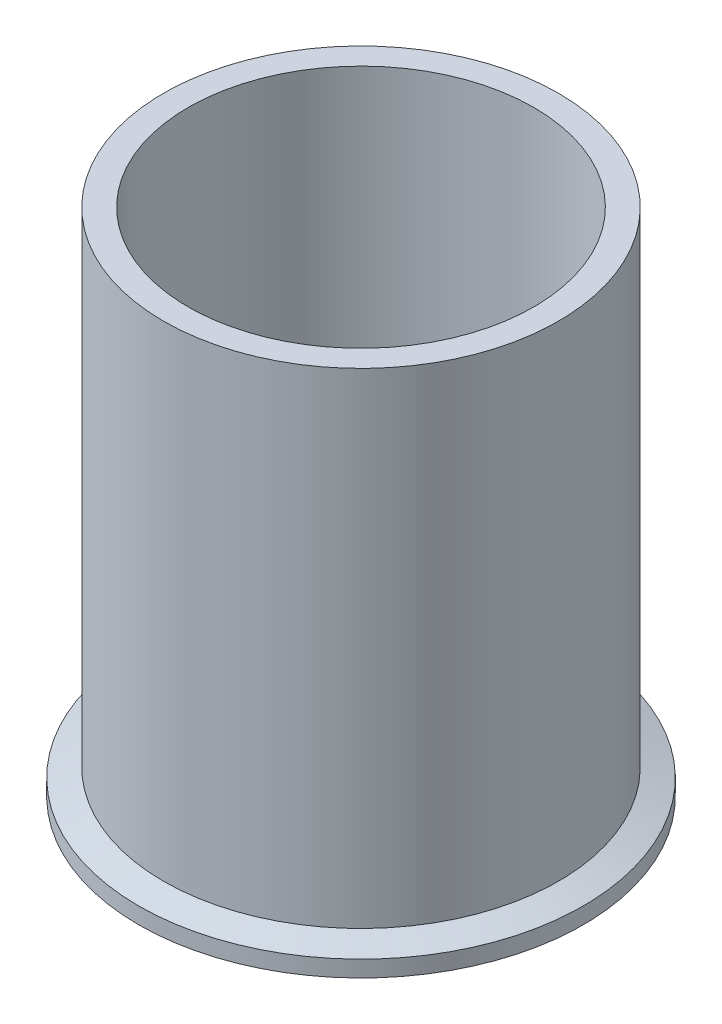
ISO-10303-21;
HEADER;
FILE_DESCRIPTION(('STEP AP214'),'2;1');
FILE_NAME('part.step','',(''),(''),'','','');
FILE_SCHEMA(('AUTOMOTIVE_DESIGN { 1 0 10303 214 1 1 1 1 }'));
ENDSEC;
DATA;
#1=APPLICATION_CONTEXT('core data for automotive mechanical design processes');
#2=APPLICATION_PROTOCOL_DEFINITION('international standard','automotive_design',2000,#1);
#3=PRODUCT_CONTEXT('',#1,'mechanical');
#4=PRODUCT('Part','Part','',(#3));
#5=PRODUCT_RELATED_PRODUCT_CATEGORY('part','',(#4));
#6=PRODUCT_DEFINITION_FORMATION('','',#4);
#7=PRODUCT_DEFINITION_CONTEXT('part definition',#1,'design');
#8=PRODUCT_DEFINITION('design','',#6,#7);
#9=PRODUCT_DEFINITION_SHAPE('','',#8);
#10=(LENGTH_UNIT() NAMED_UNIT(*) SI_UNIT(.MILLI.,.METRE.));
#11=(NAMED_UNIT(*) PLANE_ANGLE_UNIT() SI_UNIT($,.RADIAN.));
#12=(NAMED_UNIT(*) SI_UNIT($,.STERADIAN.) SOLID_ANGLE_UNIT());
#13=UNCERTAINTY_MEASURE_WITH_UNIT(LENGTH_MEASURE(1.E-05),#10,'distance_accuracy_value','');
#14=(GEOMETRIC_REPRESENTATION_CONTEXT(3) GLOBAL_UNCERTAINTY_ASSIGNED_CONTEXT((#13)) GLOBAL_UNIT_ASSIGNED_CONTEXT((#10,
#11,#12)) REPRESENTATION_CONTEXT('',''));
#15=CARTESIAN_POINT('',(0.,0.,0.));
#16=DIRECTION('',(0.,0.,1.));
#17=DIRECTION('',(1.,0.,0.));
#18=AXIS2_PLACEMENT_3D('',#15,#16,#17);
#19=CARTESIAN_POINT('',(0.,0.,0.));
#20=DIRECTION('',(0.,-1.,0.));
#21=DIRECTION('',(0.,0.,-1.));
#22=AXIS2_PLACEMENT_3D('',#19,#20,#21);
#23=CONICAL_SURFACE('',#22,36.788103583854,0.401425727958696);
#24=CARTESIAN_POINT('',(0.,0.872854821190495,0.));
#25=DIRECTION('',(0.,-1.,0.));
#26=DIRECTION('',(0.,0.,-1.));
#27=AXIS2_PLACEMENT_3D('',#24,#25,#26);
#28=CIRCLE('',#27,36.4175986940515);
#29=CARTESIAN_POINT('',(0.,0.872854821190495,-36.4175986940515));
#30=VERTEX_POINT('',#29);
#31=EDGE_CURVE('E10',#30,#30,#28,.T.);
#32=ORIENTED_EDGE('',*,*,#31,.F.);
#33=EDGE_LOOP('',(#32));
#34=FACE_BOUND('',#33,.T.);
#35=CARTESIAN_POINT('',(0.,0.,0.));
#36=DIRECTION('',(0.,-1.,0.));
#37=DIRECTION('',(0.,0.,-1.));
#38=AXIS2_PLACEMENT_3D('',#35,#36,#37);
#39=CIRCLE('',#38,36.788103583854);
#40=CARTESIAN_POINT('',(0.,0.,-36.788103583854));
#41=VERTEX_POINT('',#40);
#42=EDGE_CURVE('E67',#41,#41,#39,.T.);
#43=ORIENTED_EDGE('',*,*,#42,.T.);
#44=EDGE_LOOP('',(#43));
#45=FACE_BOUND('',#44,.T.);
#46=ADVANCED_FACE('F33',(#34,#45),#23,.F.);
#47=CARTESIAN_POINT('',(0.,0.4064,0.));
#48=DIRECTION('',(0.,-1.,0.));
#49=DIRECTION('',(0.,0.,-1.));
#50=AXIS2_PLACEMENT_3D('',#47,#48,#49);
#51=TOROIDAL_SURFACE('',#50,35.3187,1.1938);
#52=CARTESIAN_POINT('',(0.,0.762227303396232,0.));
#53=DIRECTION('',(0.,-1.,0.));
#54=DIRECTION('',(0.,0.,-1.));
#55=AXIS2_PLACEMENT_3D('',#52,#53,#54);
#56=CIRCLE('',#55,34.1791626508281);
#57=CARTESIAN_POINT('',(0.,0.762227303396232,-34.1791626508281));
#58=VERTEX_POINT('',#57);
#59=EDGE_CURVE('E39',#58,#58,#56,.T.);
#60=ORIENTED_EDGE('',*,*,#59,.F.);
#61=EDGE_LOOP('',(#60));
#62=FACE_BOUND('',#61,.T.);
#63=ORIENTED_EDGE('',*,*,#31,.T.);
#64=EDGE_LOOP('',(#63));
#65=FACE_BOUND('',#64,.T.);
#66=ADVANCED_FACE('F114',(#62,#65),#51,.F.);
#67=CARTESIAN_POINT('',(0.,0.762227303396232,0.));
#68=DIRECTION('',(0.,1.,0.));
#69=DIRECTION('',(0.,0.,1.));
#70=AXIS2_PLACEMENT_3D('',#67,#68,#69);
#71=CONICAL_SURFACE('',#70,34.1791626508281,0.401425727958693);
#72=CARTESIAN_POINT('',(0.,0.,0.));
#73=DIRECTION('',(0.,-1.,0.));
#74=DIRECTION('',(0.,0.,-1.));
#75=AXIS2_PLACEMENT_3D('',#72,#73,#74);
#76=CIRCLE('',#75,33.855616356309);
#77=CARTESIAN_POINT('',(0.,0.,-33.855616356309));
#78=VERTEX_POINT('',#77);
#79=EDGE_CURVE('E43',#78,#78,#76,.T.);
#80=ORIENTED_EDGE('',*,*,#79,.F.);
#81=EDGE_LOOP('',(#80));
#82=FACE_BOUND('',#81,.T.);
#83=ORIENTED_EDGE('',*,*,#59,.T.);
#84=EDGE_LOOP('',(#83));
#85=FACE_BOUND('',#84,.T.);
#86=ADVANCED_FACE('F110',(#82,#85),#71,.T.);
#87=CARTESIAN_POINT('',(0.,0.,0.));
#88=DIRECTION('',(0.,1.,0.));
#89=DIRECTION('',(0.,0.,1.));
#90=AXIS2_PLACEMENT_3D('',#87,#88,#89);
#91=PLANE('',#90);
#92=CARTESIAN_POINT('',(0.,0.,0.));
#93=DIRECTION('',(0.,-1.,0.));
#94=DIRECTION('',(0.,0.,-1.));
#95=AXIS2_PLACEMENT_3D('',#92,#93,#94);
#96=CIRCLE('',#95,30.099);
#97=CARTESIAN_POINT('',(0.,0.,-30.099));
#98=VERTEX_POINT('',#97);
#99=EDGE_CURVE('E47',#98,#98,#96,.T.);
#100=ORIENTED_EDGE('',*,*,#99,.F.);
#101=EDGE_LOOP('',(#100));
#102=FACE_BOUND('',#101,.T.);
#103=ORIENTED_EDGE('',*,*,#79,.T.);
#104=EDGE_LOOP('',(#103));
#105=FACE_BOUND('',#104,.T.);
#106=ADVANCED_FACE('F104',(#102,#105),#91,.F.);
#107=CARTESIAN_POINT('',(0.,0.,0.));
#108=DIRECTION('',(0.,-1.,0.));
#109=DIRECTION('',(0.,0.,-1.));
#110=AXIS2_PLACEMENT_3D('',#107,#108,#109);
#111=CYLINDRICAL_SURFACE('',#110,30.099);
#112=ORIENTED_EDGE('',*,*,#99,.T.);
#113=EDGE_LOOP('',(#112));
#114=FACE_BOUND('',#113,.T.);
#115=CARTESIAN_POINT('',(0.,88.9,0.));
#116=DIRECTION('',(0.,-1.,0.));
#117=DIRECTION('',(0.,0.,-1.));
#118=AXIS2_PLACEMENT_3D('',#115,#116,#117);
#119=CIRCLE('',#118,30.099);
#120=CARTESIAN_POINT('',(0.,88.9,-30.099));
#121=VERTEX_POINT('',#120);
#122=EDGE_CURVE('E52',#121,#121,#119,.T.);
#123=ORIENTED_EDGE('',*,*,#122,.F.);
#124=EDGE_LOOP('',(#123));
#125=FACE_BOUND('',#124,.T.);
#126=ADVANCED_FACE('F99',(#114,#125),#111,.F.);
#127=CARTESIAN_POINT('',(0.,88.9,0.));
#128=DIRECTION('',(0.,-1.,0.));
#129=DIRECTION('',(0.,0.,-1.));
#130=AXIS2_PLACEMENT_3D('',#127,#128,#129);
#131=PLANE('',#130);
#132=CARTESIAN_POINT('',(0.,88.9,0.));
#133=DIRECTION('',(0.,-1.,0.));
#134=DIRECTION('',(0.,0.,-1.));
#135=AXIS2_PLACEMENT_3D('',#132,#133,#134);
#136=CIRCLE('',#135,34.3916);
#137=CARTESIAN_POINT('',(0.,88.9,-34.3916));
#138=VERTEX_POINT('',#137);
#139=EDGE_CURVE('E55',#138,#138,#136,.T.);
#140=ORIENTED_EDGE('',*,*,#139,.F.);
#141=EDGE_LOOP('',(#140));
#142=FACE_BOUND('',#141,.T.);
#143=ORIENTED_EDGE('',*,*,#122,.T.);
#144=EDGE_LOOP('',(#143));
#145=FACE_BOUND('',#144,.T.);
#146=ADVANCED_FACE('F93',(#142,#145),#131,.F.);
#147=CARTESIAN_POINT('',(0.,0.,0.));
#148=DIRECTION('',(0.,-1.,0.));
#149=DIRECTION('',(0.,0.,-1.));
#150=AXIS2_PLACEMENT_3D('',#147,#148,#149);
#151=CYLINDRICAL_SURFACE('',#150,34.3916);
#152=CARTESIAN_POINT('',(0.,4.41642347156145,0.));
#153=DIRECTION('',(0.,-1.,0.));
#154=DIRECTION('',(0.,0.,-1.));
#155=AXIS2_PLACEMENT_3D('',#152,#153,#154);
#156=CIRCLE('',#155,34.3916);
#157=CARTESIAN_POINT('',(0.,4.41642347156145,-34.3916));
#158=VERTEX_POINT('',#157);
#159=EDGE_CURVE('E58',#158,#158,#156,.T.);
#160=ORIENTED_EDGE('',*,*,#159,.F.);
#161=EDGE_LOOP('',(#160));
#162=FACE_BOUND('',#161,.T.);
#163=ORIENTED_EDGE('',*,*,#139,.T.);
#164=EDGE_LOOP('',(#163));
#165=FACE_BOUND('',#164,.T.);
#166=ADVANCED_FACE('F87',(#162,#165),#151,.T.);
#167=CARTESIAN_POINT('',(0.,4.41642347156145,0.));
#168=DIRECTION('',(0.,-1.,0.));
#169=DIRECTION('',(0.,0.,-1.));
#170=AXIS2_PLACEMENT_3D('',#167,#168,#169);
#171=CONICAL_SURFACE('',#170,34.3916,1.22173047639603);
#172=CARTESIAN_POINT('',(0.,2.8448,0.));
#173=DIRECTION('',(0.,-1.,0.));
#174=DIRECTION('',(0.,0.,-1.));
#175=AXIS2_PLACEMENT_3D('',#172,#173,#174);
#176=CIRCLE('',#175,38.7096);
#177=CARTESIAN_POINT('',(0.,2.8448,-38.7096));
#178=VERTEX_POINT('',#177);
#179=EDGE_CURVE('E61',#178,#178,#176,.T.);
#180=ORIENTED_EDGE('',*,*,#179,.F.);
#181=EDGE_LOOP('',(#180));
#182=FACE_BOUND('',#181,.T.);
#183=ORIENTED_EDGE('',*,*,#159,.T.);
#184=EDGE_LOOP('',(#183));
#185=FACE_BOUND('',#184,.T.);
#186=ADVANCED_FACE('F81',(#182,#185),#171,.T.);
#187=CARTESIAN_POINT('',(0.,0.,0.));
#188=DIRECTION('',(0.,-1.,0.));
#189=DIRECTION('',(0.,0.,-1.));
#190=AXIS2_PLACEMENT_3D('',#187,#188,#189);
#191=CYLINDRICAL_SURFACE('',#190,38.7096);
#192=CARTESIAN_POINT('',(0.,0.,0.));
#193=DIRECTION('',(0.,-1.,0.));
#194=DIRECTION('',(0.,0.,-1.));
#195=AXIS2_PLACEMENT_3D('',#192,#193,#194);
#196=CIRCLE('',#195,38.7096);
#197=CARTESIAN_POINT('',(0.,0.,-38.7096));
#198=VERTEX_POINT('',#197);
#199=EDGE_CURVE('E64',#198,#198,#196,.T.);
#200=ORIENTED_EDGE('',*,*,#199,.F.);
#201=EDGE_LOOP('',(#200));
#202=FACE_BOUND('',#201,.T.);
#203=ORIENTED_EDGE('',*,*,#179,.T.);
#204=EDGE_LOOP('',(#203));
#205=FACE_BOUND('',#204,.T.);
#206=ADVANCED_FACE('F75',(#202,#205),#191,.T.);
#207=CARTESIAN_POINT('',(0.,0.,0.));
#208=DIRECTION('',(0.,1.,0.));
#209=DIRECTION('',(0.,0.,1.));
#210=AXIS2_PLACEMENT_3D('',#207,#208,#209);
#211=PLANE('',#210);
#212=ORIENTED_EDGE('',*,*,#42,.F.);
#213=EDGE_LOOP('',(#212));
#214=FACE_BOUND('',#213,.T.);
#215=ORIENTED_EDGE('',*,*,#199,.T.);
#216=EDGE_LOOP('',(#215));
#217=FACE_BOUND('',#216,.T.);
#218=ADVANCED_FACE('F72',(#214,#217),#211,.F.);
#219=CLOSED_SHELL('',(#46,#66,#86,#106,#126,#146,#166,#186,#206,#218));
#220=MANIFOLD_SOLID_BREP('B2',#219);
#221=ADVANCED_BREP_SHAPE_REPRESENTATION('',(#18,#220),#14);
#222=SHAPE_DEFINITION_REPRESENTATION(#9,#221);
ENDSEC;
END-ISO-10303-21;
